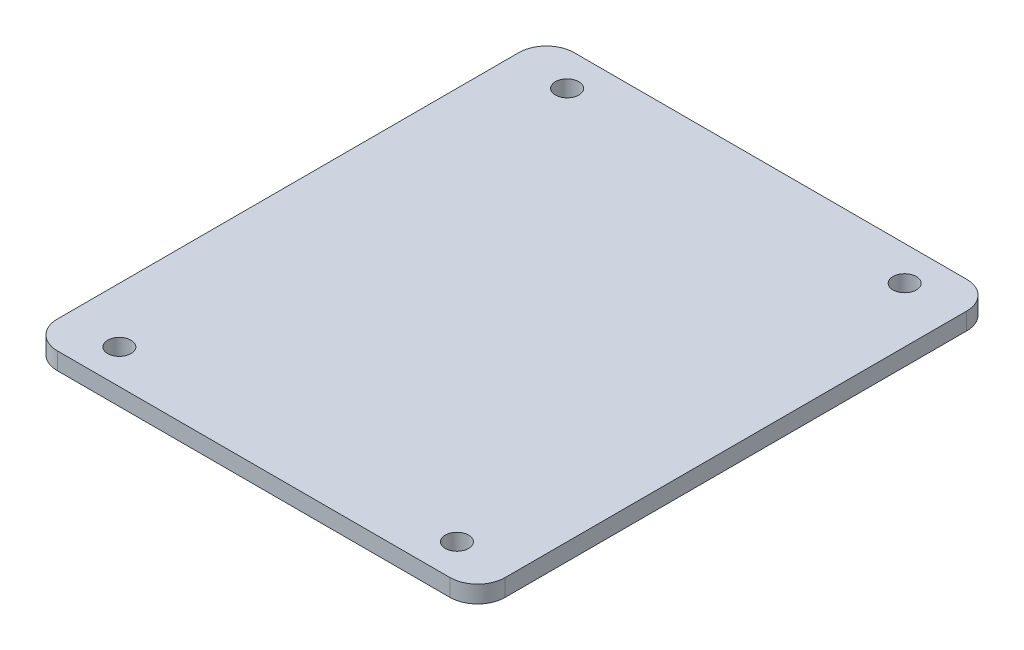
ISO-10303-21;
HEADER;
FILE_DESCRIPTION(('STEP AP214'),'2;1');
FILE_NAME('part.step','',(''),(''),'','','');
FILE_SCHEMA(('AUTOMOTIVE_DESIGN { 1 0 10303 214 1 1 1 1 }'));
ENDSEC;
DATA;
#1=APPLICATION_CONTEXT('core data for automotive mechanical design processes');
#2=APPLICATION_PROTOCOL_DEFINITION('international standard','automotive_design',2000,#1);
#3=PRODUCT_CONTEXT('',#1,'mechanical');
#4=PRODUCT('Part','Part','',(#3));
#5=PRODUCT_RELATED_PRODUCT_CATEGORY('part','',(#4));
#6=PRODUCT_DEFINITION_FORMATION('','',#4);
#7=PRODUCT_DEFINITION_CONTEXT('part definition',#1,'design');
#8=PRODUCT_DEFINITION('design','',#6,#7);
#9=PRODUCT_DEFINITION_SHAPE('','',#8);
#10=(LENGTH_UNIT() NAMED_UNIT(*) SI_UNIT(.MILLI.,.METRE.));
#11=(NAMED_UNIT(*) PLANE_ANGLE_UNIT() SI_UNIT($,.RADIAN.));
#12=(NAMED_UNIT(*) SI_UNIT($,.STERADIAN.) SOLID_ANGLE_UNIT());
#13=UNCERTAINTY_MEASURE_WITH_UNIT(LENGTH_MEASURE(1.E-05),#10,'distance_accuracy_value','');
#14=(GEOMETRIC_REPRESENTATION_CONTEXT(3) GLOBAL_UNCERTAINTY_ASSIGNED_CONTEXT((#13)) GLOBAL_UNIT_ASSIGNED_CONTEXT((#10,
#11,#12)) REPRESENTATION_CONTEXT('',''));
#15=CARTESIAN_POINT('',(0.,0.,0.));
#16=DIRECTION('',(0.,0.,1.));
#17=DIRECTION('',(1.,0.,0.));
#18=AXIS2_PLACEMENT_3D('',#15,#16,#17);
#19=CARTESIAN_POINT('',(-41.275,3.175,47.625));
#20=DIRECTION('',(1.,0.,0.));
#21=DIRECTION('',(0.,0.,-1.));
#22=AXIS2_PLACEMENT_3D('',#19,#20,#21);
#23=PLANE('',#22);
#24=DIRECTION('',(0.,0.,1.));
#25=VECTOR('',#24,1.);
#26=CARTESIAN_POINT('',(-41.275,3.175,47.625));
#27=LINE('',#26,#25);
#28=CARTESIAN_POINT('',(-41.275,3.175,-42.545));
#29=VERTEX_POINT('',#28);
#30=CARTESIAN_POINT('',(-41.275,3.175,42.545));
#31=VERTEX_POINT('',#30);
#32=EDGE_CURVE('E137',#29,#31,#27,.T.);
#33=ORIENTED_EDGE('',*,*,#32,.F.);
#34=DIRECTION('',(0.,-1.,0.));
#35=VECTOR('',#34,1.);
#36=CARTESIAN_POINT('',(-41.275,3.175,-42.545));
#37=LINE('',#36,#35);
#38=CARTESIAN_POINT('',(-41.275,0.,-42.545));
#39=VERTEX_POINT('',#38);
#40=EDGE_CURVE('E176',#29,#39,#37,.T.);
#41=ORIENTED_EDGE('',*,*,#40,.T.);
#42=DIRECTION('',(0.,0.,1.));
#43=VECTOR('',#42,1.);
#44=CARTESIAN_POINT('',(-41.275,0.,47.625));
#45=LINE('',#44,#43);
#46=CARTESIAN_POINT('',(-41.275,0.,42.545));
#47=VERTEX_POINT('',#46);
#48=EDGE_CURVE('E191',#39,#47,#45,.T.);
#49=ORIENTED_EDGE('',*,*,#48,.T.);
#50=DIRECTION('',(0.,-1.,0.));
#51=VECTOR('',#50,1.);
#52=CARTESIAN_POINT('',(-41.275,3.175,42.545));
#53=LINE('',#52,#51);
#54=EDGE_CURVE('E173',#47,#31,#53,.F.);
#55=ORIENTED_EDGE('',*,*,#54,.T.);
#56=EDGE_LOOP('',(#33,#41,#49,#55));
#57=FACE_BOUND('',#56,.T.);
#58=ADVANCED_FACE('F41',(#57),#23,.F.);
#59=CARTESIAN_POINT('',(41.275,3.175,47.625));
#60=DIRECTION('',(0.,0.,-1.));
#61=DIRECTION('',(-1.,0.,0.));
#62=AXIS2_PLACEMENT_3D('',#59,#60,#61);
#63=PLANE('',#62);
#64=DIRECTION('',(1.,0.,0.));
#65=VECTOR('',#64,1.);
#66=CARTESIAN_POINT('',(41.275,3.175,47.625));
#67=LINE('',#66,#65);
#68=CARTESIAN_POINT('',(-36.195,3.175,47.625));
#69=VERTEX_POINT('',#68);
#70=CARTESIAN_POINT('',(36.195,3.175,47.625));
#71=VERTEX_POINT('',#70);
#72=EDGE_CURVE('E142',#69,#71,#67,.T.);
#73=ORIENTED_EDGE('',*,*,#72,.F.);
#74=DIRECTION('',(0.,-1.,0.));
#75=VECTOR('',#74,1.);
#76=CARTESIAN_POINT('',(-36.195,3.175,47.625));
#77=LINE('',#76,#75);
#78=CARTESIAN_POINT('',(-36.195,0.,47.625));
#79=VERTEX_POINT('',#78);
#80=EDGE_CURVE('E11',#69,#79,#77,.T.);
#81=ORIENTED_EDGE('',*,*,#80,.T.);
#82=DIRECTION('',(1.,0.,0.));
#83=VECTOR('',#82,1.);
#84=CARTESIAN_POINT('',(41.275,0.,47.625));
#85=LINE('',#84,#83);
#86=CARTESIAN_POINT('',(36.195,0.,47.625));
#87=VERTEX_POINT('',#86);
#88=EDGE_CURVE('E144',#79,#87,#85,.T.);
#89=ORIENTED_EDGE('',*,*,#88,.T.);
#90=DIRECTION('',(0.,-1.,0.));
#91=VECTOR('',#90,1.);
#92=CARTESIAN_POINT('',(36.195,3.175,47.625));
#93=LINE('',#92,#91);
#94=EDGE_CURVE('E50',#87,#71,#93,.F.);
#95=ORIENTED_EDGE('',*,*,#94,.T.);
#96=EDGE_LOOP('',(#73,#81,#89,#95));
#97=FACE_BOUND('',#96,.T.);
#98=ADVANCED_FACE('F197',(#97),#63,.F.);
#99=CARTESIAN_POINT('',(41.275,3.175,47.625));
#100=DIRECTION('',(-1.,0.,0.));
#101=DIRECTION('',(0.,0.,1.));
#102=AXIS2_PLACEMENT_3D('',#99,#100,#101);
#103=PLANE('',#102);
#104=DIRECTION('',(0.,0.,-1.));
#105=VECTOR('',#104,1.);
#106=CARTESIAN_POINT('',(41.275,0.,47.625));
#107=LINE('',#106,#105);
#108=CARTESIAN_POINT('',(41.275,0.,42.545));
#109=VERTEX_POINT('',#108);
#110=CARTESIAN_POINT('',(41.275,0.,-42.545));
#111=VERTEX_POINT('',#110);
#112=EDGE_CURVE('E138',#109,#111,#107,.T.);
#113=ORIENTED_EDGE('',*,*,#112,.T.);
#114=DIRECTION('',(0.,-1.,0.));
#115=VECTOR('',#114,1.);
#116=CARTESIAN_POINT('',(41.275,3.175,-42.545));
#117=LINE('',#116,#115);
#118=CARTESIAN_POINT('',(41.275,3.175,-42.545));
#119=VERTEX_POINT('',#118);
#120=EDGE_CURVE('E113',#111,#119,#117,.F.);
#121=ORIENTED_EDGE('',*,*,#120,.T.);
#122=DIRECTION('',(0.,0.,-1.));
#123=VECTOR('',#122,1.);
#124=CARTESIAN_POINT('',(41.275,3.175,47.625));
#125=LINE('',#124,#123);
#126=CARTESIAN_POINT('',(41.275,3.175,42.545));
#127=VERTEX_POINT('',#126);
#128=EDGE_CURVE('E182',#127,#119,#125,.T.);
#129=ORIENTED_EDGE('',*,*,#128,.F.);
#130=DIRECTION('',(0.,-1.,0.));
#131=VECTOR('',#130,1.);
#132=CARTESIAN_POINT('',(41.275,3.175,42.545));
#133=LINE('',#132,#131);
#134=EDGE_CURVE('E119',#127,#109,#133,.T.);
#135=ORIENTED_EDGE('',*,*,#134,.T.);
#136=EDGE_LOOP('',(#113,#121,#129,#135));
#137=FACE_BOUND('',#136,.T.);
#138=ADVANCED_FACE('F204',(#137),#103,.F.);
#139=CARTESIAN_POINT('',(41.275,3.175,-47.625));
#140=DIRECTION('',(0.,0.,1.));
#141=DIRECTION('',(1.,0.,0.));
#142=AXIS2_PLACEMENT_3D('',#139,#140,#141);
#143=PLANE('',#142);
#144=DIRECTION('',(-1.,0.,0.));
#145=VECTOR('',#144,1.);
#146=CARTESIAN_POINT('',(41.275,3.175,-47.625));
#147=LINE('',#146,#145);
#148=CARTESIAN_POINT('',(36.195,3.175,-47.625));
#149=VERTEX_POINT('',#148);
#150=CARTESIAN_POINT('',(-36.195,3.175,-47.625));
#151=VERTEX_POINT('',#150);
#152=EDGE_CURVE('E129',#149,#151,#147,.T.);
#153=ORIENTED_EDGE('',*,*,#152,.F.);
#154=DIRECTION('',(0.,-1.,0.));
#155=VECTOR('',#154,1.);
#156=CARTESIAN_POINT('',(36.195,3.175,-47.625));
#157=LINE('',#156,#155);
#158=CARTESIAN_POINT('',(36.195,0.,-47.625));
#159=VERTEX_POINT('',#158);
#160=EDGE_CURVE('E112',#149,#159,#157,.T.);
#161=ORIENTED_EDGE('',*,*,#160,.T.);
#162=DIRECTION('',(-1.,0.,0.));
#163=VECTOR('',#162,1.);
#164=CARTESIAN_POINT('',(41.275,0.,-47.625));
#165=LINE('',#164,#163);
#166=CARTESIAN_POINT('',(-36.195,0.,-47.625));
#167=VERTEX_POINT('',#166);
#168=EDGE_CURVE('E126',#159,#167,#165,.T.);
#169=ORIENTED_EDGE('',*,*,#168,.T.);
#170=DIRECTION('',(0.,-1.,0.));
#171=VECTOR('',#170,1.);
#172=CARTESIAN_POINT('',(-36.195,3.175,-47.625));
#173=LINE('',#172,#171);
#174=EDGE_CURVE('E132',#167,#151,#173,.F.);
#175=ORIENTED_EDGE('',*,*,#174,.T.);
#176=EDGE_LOOP('',(#153,#161,#169,#175));
#177=FACE_BOUND('',#176,.T.);
#178=ADVANCED_FACE('F125',(#177),#143,.F.);
#179=CARTESIAN_POINT('',(0.,3.175,0.));
#180=DIRECTION('',(0.,1.,0.));
#181=DIRECTION('',(0.,0.,1.));
#182=AXIS2_PLACEMENT_3D('',#179,#180,#181);
#183=PLANE('',#182);
#184=CARTESIAN_POINT('',(-31.115,3.175,41.275));
#185=DIRECTION('',(0.,-1.,0.));
#186=DIRECTION('',(0.,0.,-1.));
#187=AXIS2_PLACEMENT_3D('',#184,#185,#186);
#188=CIRCLE('',#187,2.15);
#189=CARTESIAN_POINT('',(-31.115,3.175,39.125));
#190=VERTEX_POINT('',#189);
#191=EDGE_CURVE('E354',#190,#190,#188,.T.);
#192=ORIENTED_EDGE('',*,*,#191,.T.);
#193=EDGE_LOOP('',(#192));
#194=FACE_BOUND('',#193,.T.);
#195=CARTESIAN_POINT('',(-31.115,3.175,-41.275));
#196=DIRECTION('',(0.,-1.,0.));
#197=DIRECTION('',(0.,0.,-1.));
#198=AXIS2_PLACEMENT_3D('',#195,#196,#197);
#199=CIRCLE('',#198,2.15);
#200=CARTESIAN_POINT('',(-31.115,3.175,-43.425));
#201=VERTEX_POINT('',#200);
#202=EDGE_CURVE('E362',#201,#201,#199,.T.);
#203=ORIENTED_EDGE('',*,*,#202,.T.);
#204=EDGE_LOOP('',(#203));
#205=FACE_BOUND('',#204,.T.);
#206=CARTESIAN_POINT('',(31.115,3.175,-41.275));
#207=DIRECTION('',(0.,-1.,0.));
#208=DIRECTION('',(0.,0.,-1.));
#209=AXIS2_PLACEMENT_3D('',#206,#207,#208);
#210=CIRCLE('',#209,2.15);
#211=CARTESIAN_POINT('',(31.115,3.175,-43.425));
#212=VERTEX_POINT('',#211);
#213=EDGE_CURVE('E342',#212,#212,#210,.T.);
#214=ORIENTED_EDGE('',*,*,#213,.T.);
#215=EDGE_LOOP('',(#214));
#216=FACE_BOUND('',#215,.T.);
#217=CARTESIAN_POINT('',(31.115,3.175,41.275));
#218=DIRECTION('',(0.,-1.,0.));
#219=DIRECTION('',(0.,0.,-1.));
#220=AXIS2_PLACEMENT_3D('',#217,#218,#219);
#221=CIRCLE('',#220,2.15);
#222=CARTESIAN_POINT('',(31.115,3.175,39.125));
#223=VERTEX_POINT('',#222);
#224=EDGE_CURVE('E194',#223,#223,#221,.T.);
#225=ORIENTED_EDGE('',*,*,#224,.T.);
#226=EDGE_LOOP('',(#225));
#227=FACE_BOUND('',#226,.T.);
#228=ORIENTED_EDGE('',*,*,#128,.T.);
#229=CARTESIAN_POINT('',(36.195,3.175,-42.545));
#230=DIRECTION('',(0.,1.,0.));
#231=DIRECTION('',(0.,0.,1.));
#232=AXIS2_PLACEMENT_3D('',#229,#230,#231);
#233=CIRCLE('',#232,5.08);
#234=EDGE_CURVE('E170',#119,#149,#233,.T.);
#235=ORIENTED_EDGE('',*,*,#234,.T.);
#236=ORIENTED_EDGE('',*,*,#152,.T.);
#237=CARTESIAN_POINT('',(-36.195,3.175,-42.545));
#238=DIRECTION('',(0.,1.,0.));
#239=DIRECTION('',(0.,0.,1.));
#240=AXIS2_PLACEMENT_3D('',#237,#238,#239);
#241=CIRCLE('',#240,5.08);
#242=EDGE_CURVE('E167',#151,#29,#241,.T.);
#243=ORIENTED_EDGE('',*,*,#242,.T.);
#244=ORIENTED_EDGE('',*,*,#32,.T.);
#245=CARTESIAN_POINT('',(-36.195,3.175,42.545));
#246=DIRECTION('',(0.,1.,0.));
#247=DIRECTION('',(0.,0.,1.));
#248=AXIS2_PLACEMENT_3D('',#245,#246,#247);
#249=CIRCLE('',#248,5.08);
#250=EDGE_CURVE('E63',#31,#69,#249,.T.);
#251=ORIENTED_EDGE('',*,*,#250,.T.);
#252=ORIENTED_EDGE('',*,*,#72,.T.);
#253=CARTESIAN_POINT('',(36.195,3.175,42.545));
#254=DIRECTION('',(0.,1.,0.));
#255=DIRECTION('',(0.,0.,1.));
#256=AXIS2_PLACEMENT_3D('',#253,#254,#255);
#257=CIRCLE('',#256,5.08);
#258=EDGE_CURVE('E162',#71,#127,#257,.T.);
#259=ORIENTED_EDGE('',*,*,#258,.T.);
#260=EDGE_LOOP('',(#228,#235,#236,#243,#244,#251,#252,#259));
#261=FACE_BOUND('',#260,.T.);
#262=ADVANCED_FACE('F202',(#194,#205,#216,#227,#261),#183,.T.);
#263=CARTESIAN_POINT('',(0.,0.,0.));
#264=DIRECTION('',(0.,1.,0.));
#265=DIRECTION('',(0.,0.,1.));
#266=AXIS2_PLACEMENT_3D('',#263,#264,#265);
#267=PLANE('',#266);
#268=CARTESIAN_POINT('',(-31.115,0.,41.275));
#269=DIRECTION('',(0.,-1.,0.));
#270=DIRECTION('',(0.,0.,-1.));
#271=AXIS2_PLACEMENT_3D('',#268,#269,#270);
#272=CIRCLE('',#271,2.15);
#273=CARTESIAN_POINT('',(-31.115,0.,39.125));
#274=VERTEX_POINT('',#273);
#275=EDGE_CURVE('E350',#274,#274,#272,.T.);
#276=ORIENTED_EDGE('',*,*,#275,.F.);
#277=EDGE_LOOP('',(#276));
#278=FACE_BOUND('',#277,.T.);
#279=CARTESIAN_POINT('',(-31.115,0.,-41.275));
#280=DIRECTION('',(0.,-1.,0.));
#281=DIRECTION('',(0.,0.,-1.));
#282=AXIS2_PLACEMENT_3D('',#279,#280,#281);
#283=CIRCLE('',#282,2.15);
#284=CARTESIAN_POINT('',(-31.115,0.,-43.425));
#285=VERTEX_POINT('',#284);
#286=EDGE_CURVE('E358',#285,#285,#283,.T.);
#287=ORIENTED_EDGE('',*,*,#286,.F.);
#288=EDGE_LOOP('',(#287));
#289=FACE_BOUND('',#288,.T.);
#290=CARTESIAN_POINT('',(31.115,0.,-41.275));
#291=DIRECTION('',(0.,-1.,0.));
#292=DIRECTION('',(0.,0.,-1.));
#293=AXIS2_PLACEMENT_3D('',#290,#291,#292);
#294=CIRCLE('',#293,2.15);
#295=CARTESIAN_POINT('',(31.115,0.,-43.425));
#296=VERTEX_POINT('',#295);
#297=EDGE_CURVE('E347',#296,#296,#294,.T.);
#298=ORIENTED_EDGE('',*,*,#297,.F.);
#299=EDGE_LOOP('',(#298));
#300=FACE_BOUND('',#299,.T.);
#301=CARTESIAN_POINT('',(31.115,0.,41.275));
#302=DIRECTION('',(0.,-1.,0.));
#303=DIRECTION('',(0.,0.,-1.));
#304=AXIS2_PLACEMENT_3D('',#301,#302,#303);
#305=CIRCLE('',#304,2.15);
#306=CARTESIAN_POINT('',(31.115,0.,39.125));
#307=VERTEX_POINT('',#306);
#308=EDGE_CURVE('E339',#307,#307,#305,.T.);
#309=ORIENTED_EDGE('',*,*,#308,.F.);
#310=EDGE_LOOP('',(#309));
#311=FACE_BOUND('',#310,.T.);
#312=ORIENTED_EDGE('',*,*,#168,.F.);
#313=CARTESIAN_POINT('',(36.195,0.,-42.545));
#314=DIRECTION('',(0.,1.,0.));
#315=DIRECTION('',(0.,0.,1.));
#316=AXIS2_PLACEMENT_3D('',#313,#314,#315);
#317=CIRCLE('',#316,5.08);
#318=EDGE_CURVE('E108',#159,#111,#317,.F.);
#319=ORIENTED_EDGE('',*,*,#318,.T.);
#320=ORIENTED_EDGE('',*,*,#112,.F.);
#321=CARTESIAN_POINT('',(36.195,0.,42.545));
#322=DIRECTION('',(0.,1.,0.));
#323=DIRECTION('',(0.,0.,1.));
#324=AXIS2_PLACEMENT_3D('',#321,#322,#323);
#325=CIRCLE('',#324,5.08);
#326=EDGE_CURVE('E131',#109,#87,#325,.F.);
#327=ORIENTED_EDGE('',*,*,#326,.T.);
#328=ORIENTED_EDGE('',*,*,#88,.F.);
#329=CARTESIAN_POINT('',(-36.195,0.,42.545));
#330=DIRECTION('',(0.,1.,0.));
#331=DIRECTION('',(0.,0.,1.));
#332=AXIS2_PLACEMENT_3D('',#329,#330,#331);
#333=CIRCLE('',#332,5.08);
#334=EDGE_CURVE('E152',#79,#47,#333,.F.);
#335=ORIENTED_EDGE('',*,*,#334,.T.);
#336=ORIENTED_EDGE('',*,*,#48,.F.);
#337=CARTESIAN_POINT('',(-36.195,0.,-42.545));
#338=DIRECTION('',(0.,1.,0.));
#339=DIRECTION('',(0.,0.,1.));
#340=AXIS2_PLACEMENT_3D('',#337,#338,#339);
#341=CIRCLE('',#340,5.08);
#342=EDGE_CURVE('E120',#39,#167,#341,.F.);
#343=ORIENTED_EDGE('',*,*,#342,.T.);
#344=EDGE_LOOP('',(#312,#319,#320,#327,#328,#335,#336,#343));
#345=FACE_BOUND('',#344,.T.);
#346=ADVANCED_FACE('F134',(#278,#289,#300,#311,#345),#267,.F.);
#347=CARTESIAN_POINT('',(31.115,3.175,41.275));
#348=DIRECTION('',(0.,-1.,0.));
#349=DIRECTION('',(0.,0.,-1.));
#350=AXIS2_PLACEMENT_3D('',#347,#348,#349);
#351=CYLINDRICAL_SURFACE('',#350,2.15);
#352=ORIENTED_EDGE('',*,*,#224,.F.);
#353=EDGE_LOOP('',(#352));
#354=FACE_BOUND('',#353,.T.);
#355=ORIENTED_EDGE('',*,*,#308,.T.);
#356=EDGE_LOOP('',(#355));
#357=FACE_BOUND('',#356,.T.);
#358=ADVANCED_FACE('F264',(#354,#357),#351,.F.);
#359=CARTESIAN_POINT('',(31.115,3.175,-41.275));
#360=DIRECTION('',(0.,-1.,0.));
#361=DIRECTION('',(0.,0.,-1.));
#362=AXIS2_PLACEMENT_3D('',#359,#360,#361);
#363=CYLINDRICAL_SURFACE('',#362,2.15);
#364=ORIENTED_EDGE('',*,*,#213,.F.);
#365=EDGE_LOOP('',(#364));
#366=FACE_BOUND('',#365,.T.);
#367=ORIENTED_EDGE('',*,*,#297,.T.);
#368=EDGE_LOOP('',(#367));
#369=FACE_BOUND('',#368,.T.);
#370=ADVANCED_FACE('F313',(#366,#369),#363,.F.);
#371=CARTESIAN_POINT('',(-31.115,3.175,-41.275));
#372=DIRECTION('',(0.,-1.,0.));
#373=DIRECTION('',(0.,0.,-1.));
#374=AXIS2_PLACEMENT_3D('',#371,#372,#373);
#375=CYLINDRICAL_SURFACE('',#374,2.15);
#376=ORIENTED_EDGE('',*,*,#202,.F.);
#377=EDGE_LOOP('',(#376));
#378=FACE_BOUND('',#377,.T.);
#379=ORIENTED_EDGE('',*,*,#286,.T.);
#380=EDGE_LOOP('',(#379));
#381=FACE_BOUND('',#380,.T.);
#382=ADVANCED_FACE('F303',(#378,#381),#375,.F.);
#383=CARTESIAN_POINT('',(-31.115,3.175,41.275));
#384=DIRECTION('',(0.,-1.,0.));
#385=DIRECTION('',(0.,0.,-1.));
#386=AXIS2_PLACEMENT_3D('',#383,#384,#385);
#387=CYLINDRICAL_SURFACE('',#386,2.15);
#388=ORIENTED_EDGE('',*,*,#191,.F.);
#389=EDGE_LOOP('',(#388));
#390=FACE_BOUND('',#389,.T.);
#391=ORIENTED_EDGE('',*,*,#275,.T.);
#392=EDGE_LOOP('',(#391));
#393=FACE_BOUND('',#392,.T.);
#394=ADVANCED_FACE('F223',(#390,#393),#387,.F.);
#395=CARTESIAN_POINT('',(36.195,3.175,-42.545));
#396=DIRECTION('',(0.,-1.,0.));
#397=DIRECTION('',(0.,0.,-1.));
#398=AXIS2_PLACEMENT_3D('',#395,#396,#397);
#399=CYLINDRICAL_SURFACE('',#398,5.08);
#400=ORIENTED_EDGE('',*,*,#234,.F.);
#401=ORIENTED_EDGE('',*,*,#120,.F.);
#402=ORIENTED_EDGE('',*,*,#318,.F.);
#403=ORIENTED_EDGE('',*,*,#160,.F.);
#404=EDGE_LOOP('',(#400,#401,#402,#403));
#405=FACE_BOUND('',#404,.T.);
#406=ADVANCED_FACE('F111',(#405),#399,.T.);
#407=CARTESIAN_POINT('',(-36.195,3.175,-42.545));
#408=DIRECTION('',(0.,-1.,0.));
#409=DIRECTION('',(0.,0.,-1.));
#410=AXIS2_PLACEMENT_3D('',#407,#408,#409);
#411=CYLINDRICAL_SURFACE('',#410,5.08);
#412=ORIENTED_EDGE('',*,*,#242,.F.);
#413=ORIENTED_EDGE('',*,*,#174,.F.);
#414=ORIENTED_EDGE('',*,*,#342,.F.);
#415=ORIENTED_EDGE('',*,*,#40,.F.);
#416=EDGE_LOOP('',(#412,#413,#414,#415));
#417=FACE_BOUND('',#416,.T.);
#418=ADVANCED_FACE('F222',(#417),#411,.T.);
#419=CARTESIAN_POINT('',(-36.195,3.175,42.545));
#420=DIRECTION('',(0.,-1.,0.));
#421=DIRECTION('',(0.,0.,-1.));
#422=AXIS2_PLACEMENT_3D('',#419,#420,#421);
#423=CYLINDRICAL_SURFACE('',#422,5.08);
#424=ORIENTED_EDGE('',*,*,#250,.F.);
#425=ORIENTED_EDGE('',*,*,#54,.F.);
#426=ORIENTED_EDGE('',*,*,#334,.F.);
#427=ORIENTED_EDGE('',*,*,#80,.F.);
#428=EDGE_LOOP('',(#424,#425,#426,#427));
#429=FACE_BOUND('',#428,.T.);
#430=ADVANCED_FACE('F225',(#429),#423,.T.);
#431=CARTESIAN_POINT('',(36.195,3.175,42.545));
#432=DIRECTION('',(0.,-1.,0.));
#433=DIRECTION('',(0.,0.,-1.));
#434=AXIS2_PLACEMENT_3D('',#431,#432,#433);
#435=CYLINDRICAL_SURFACE('',#434,5.08);
#436=ORIENTED_EDGE('',*,*,#258,.F.);
#437=ORIENTED_EDGE('',*,*,#94,.F.);
#438=ORIENTED_EDGE('',*,*,#326,.F.);
#439=ORIENTED_EDGE('',*,*,#134,.F.);
#440=EDGE_LOOP('',(#436,#437,#438,#439));
#441=FACE_BOUND('',#440,.T.);
#442=ADVANCED_FACE('F43',(#441),#435,.T.);
#443=CLOSED_SHELL('',(#58,#98,#138,#178,#262,#346,#358,#370,#382,#394,#406,#418,#430,#442));
#444=MANIFOLD_SOLID_BREP('B2',#443);
#445=ADVANCED_BREP_SHAPE_REPRESENTATION('',(#18,#444),#14);
#446=SHAPE_DEFINITION_REPRESENTATION(#9,#445);
ENDSEC;
END-ISO-10303-21;
